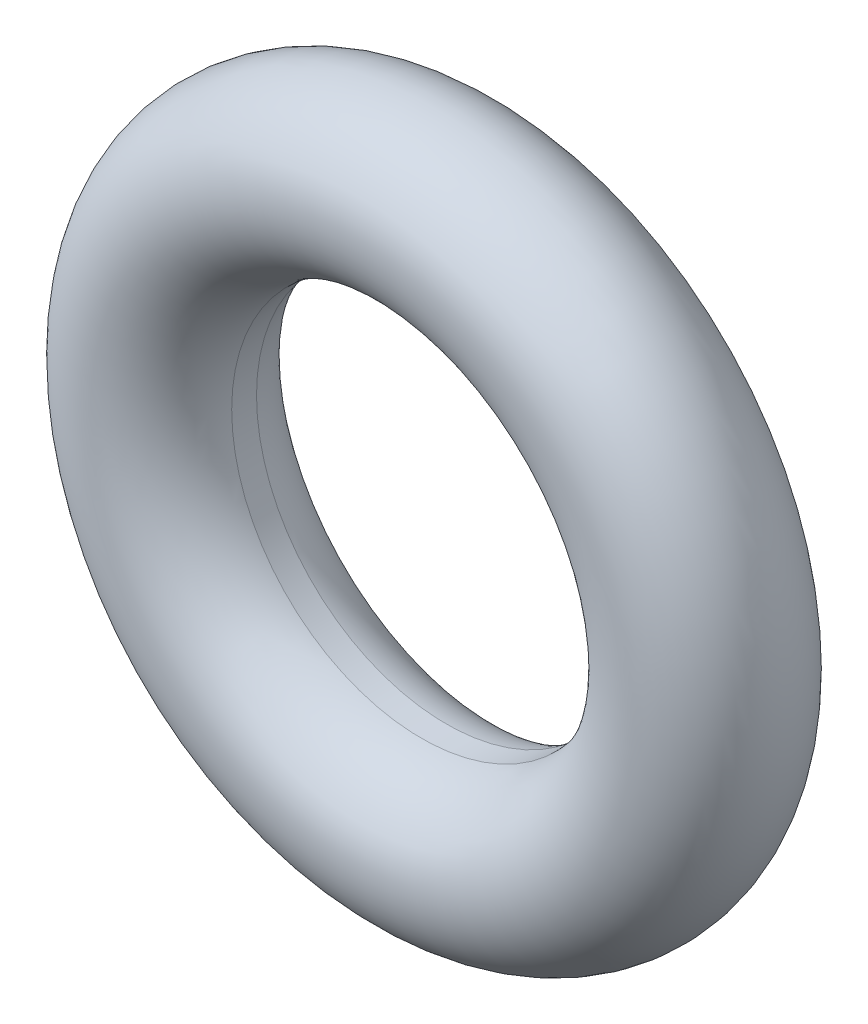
ISO-10303-21;
HEADER;
FILE_DESCRIPTION(('STEP AP214'),'2;1');
FILE_NAME('part.step','',(''),(''),'','','');
FILE_SCHEMA(('AUTOMOTIVE_DESIGN { 1 0 10303 214 1 1 1 1 }'));
ENDSEC;
DATA;
#1=APPLICATION_CONTEXT('core data for automotive mechanical design processes');
#2=APPLICATION_PROTOCOL_DEFINITION('international standard','automotive_design',2000,#1);
#3=PRODUCT_CONTEXT('',#1,'mechanical');
#4=PRODUCT('Part','Part','',(#3));
#5=PRODUCT_RELATED_PRODUCT_CATEGORY('part','',(#4));
#6=PRODUCT_DEFINITION_FORMATION('','',#4);
#7=PRODUCT_DEFINITION_CONTEXT('part definition',#1,'design');
#8=PRODUCT_DEFINITION('design','',#6,#7);
#9=PRODUCT_DEFINITION_SHAPE('','',#8);
#10=(LENGTH_UNIT() NAMED_UNIT(*) SI_UNIT(.MILLI.,.METRE.));
#11=(NAMED_UNIT(*) PLANE_ANGLE_UNIT() SI_UNIT($,.RADIAN.));
#12=(NAMED_UNIT(*) SI_UNIT($,.STERADIAN.) SOLID_ANGLE_UNIT());
#13=UNCERTAINTY_MEASURE_WITH_UNIT(LENGTH_MEASURE(1.E-05),#10,'distance_accuracy_value','');
#14=(GEOMETRIC_REPRESENTATION_CONTEXT(3) GLOBAL_UNCERTAINTY_ASSIGNED_CONTEXT((#13)) GLOBAL_UNIT_ASSIGNED_CONTEXT((#10,
#11,#12)) REPRESENTATION_CONTEXT('',''));
#15=CARTESIAN_POINT('',(0.,0.,0.));
#16=DIRECTION('',(0.,0.,1.));
#17=DIRECTION('',(1.,0.,0.));
#18=AXIS2_PLACEMENT_3D('',#15,#16,#17);
#19=CARTESIAN_POINT('',(0.,0.,0.));
#20=DIRECTION('',(0.,0.,-1.));
#21=DIRECTION('',(-1.,0.,0.));
#22=AXIS2_PLACEMENT_3D('',#19,#20,#21);
#23=TOROIDAL_SURFACE('',#22,4.32,1.31);
#24=CARTESIAN_POINT('',(0.,0.,-0.197673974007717));
#25=DIRECTION('',(0.,0.,1.));
#26=DIRECTION('',(1.,0.,0.));
#27=AXIS2_PLACEMENT_3D('',#24,#25,#26);
#28=CIRCLE('',#27,3.025);
#29=CARTESIAN_POINT('',(3.02499999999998,0.,-0.197673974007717));
#30=VERTEX_POINT('',#29);
#31=EDGE_CURVE('E10',#30,#30,#28,.F.);
#32=ORIENTED_EDGE('',*,*,#31,.F.);
#33=EDGE_LOOP('',(#32));
#34=FACE_BOUND('',#33,.T.);
#35=CARTESIAN_POINT('',(0.,0.,0.197673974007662));
#36=DIRECTION('',(0.,0.,-1.));
#37=DIRECTION('',(-1.,0.,0.));
#38=AXIS2_PLACEMENT_3D('',#35,#36,#37);
#39=CIRCLE('',#38,3.025);
#40=CARTESIAN_POINT('',(-3.02499999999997,0.,0.197673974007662));
#41=VERTEX_POINT('',#40);
#42=EDGE_CURVE('E46',#41,#41,#39,.F.);
#43=ORIENTED_EDGE('',*,*,#42,.F.);
#44=EDGE_LOOP('',(#43));
#45=FACE_BOUND('',#44,.T.);
#46=ADVANCED_FACE('F40',(#34,#45),#23,.T.);
#47=CARTESIAN_POINT('',(0.,0.,-1.30999999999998));
#48=DIRECTION('',(0.,0.,1.));
#49=DIRECTION('',(1.,0.,0.));
#50=AXIS2_PLACEMENT_3D('',#47,#48,#49);
#51=CYLINDRICAL_SURFACE('',#50,3.025);
#52=ORIENTED_EDGE('',*,*,#31,.T.);
#53=EDGE_LOOP('',(#52));
#54=FACE_BOUND('',#53,.T.);
#55=ORIENTED_EDGE('',*,*,#42,.T.);
#56=EDGE_LOOP('',(#55));
#57=FACE_BOUND('',#56,.T.);
#58=ADVANCED_FACE('F52',(#54,#57),#51,.F.);
#59=CLOSED_SHELL('',(#46,#58));
#60=MANIFOLD_SOLID_BREP('B2',#59);
#61=ADVANCED_BREP_SHAPE_REPRESENTATION('',(#18,#60),#14);
#62=SHAPE_DEFINITION_REPRESENTATION(#9,#61);
ENDSEC;
END-ISO-10303-21;
